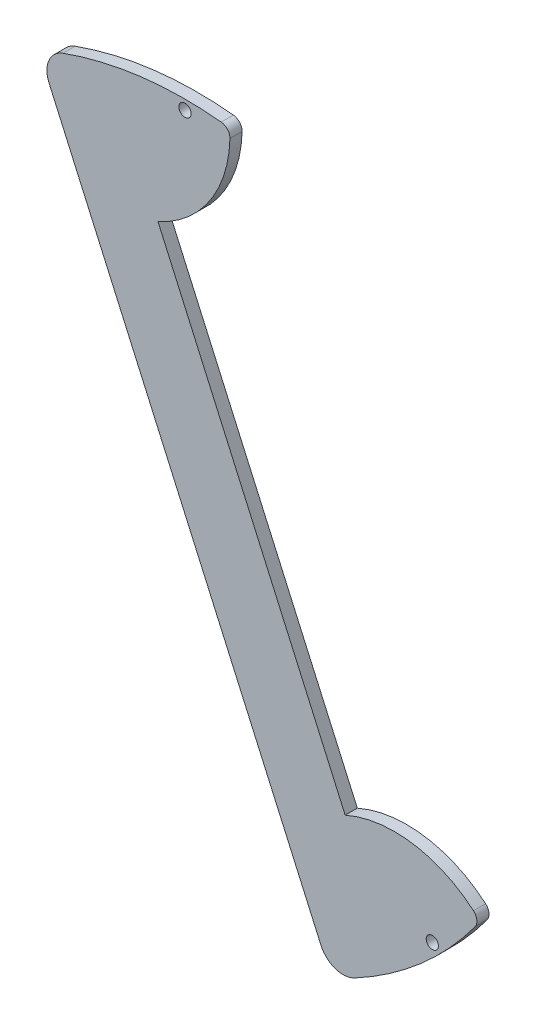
ISO-10303-21;
HEADER;
FILE_DESCRIPTION(('STEP AP214'),'2;1');
FILE_NAME('part.step','',(''),(''),'','','');
FILE_SCHEMA(('AUTOMOTIVE_DESIGN { 1 0 10303 214 1 1 1 1 }'));
ENDSEC;
DATA;
#1=APPLICATION_CONTEXT('core data for automotive mechanical design processes');
#2=APPLICATION_PROTOCOL_DEFINITION('international standard','automotive_design',2000,#1);
#3=PRODUCT_CONTEXT('',#1,'mechanical');
#4=PRODUCT('Part','Part','',(#3));
#5=PRODUCT_RELATED_PRODUCT_CATEGORY('part','',(#4));
#6=PRODUCT_DEFINITION_FORMATION('','',#4);
#7=PRODUCT_DEFINITION_CONTEXT('part definition',#1,'design');
#8=PRODUCT_DEFINITION('design','',#6,#7);
#9=PRODUCT_DEFINITION_SHAPE('','',#8);
#10=(LENGTH_UNIT() NAMED_UNIT(*) SI_UNIT(.MILLI.,.METRE.));
#11=(NAMED_UNIT(*) PLANE_ANGLE_UNIT() SI_UNIT($,.RADIAN.));
#12=(NAMED_UNIT(*) SI_UNIT($,.STERADIAN.) SOLID_ANGLE_UNIT());
#13=UNCERTAINTY_MEASURE_WITH_UNIT(LENGTH_MEASURE(1.E-05),#10,'distance_accuracy_value','');
#14=(GEOMETRIC_REPRESENTATION_CONTEXT(3) GLOBAL_UNCERTAINTY_ASSIGNED_CONTEXT((#13)) GLOBAL_UNIT_ASSIGNED_CONTEXT((#10,
#11,#12)) REPRESENTATION_CONTEXT('',''));
#15=CARTESIAN_POINT('',(0.,0.,0.));
#16=DIRECTION('',(0.,0.,1.));
#17=DIRECTION('',(1.,0.,0.));
#18=AXIS2_PLACEMENT_3D('',#15,#16,#17);
#19=CARTESIAN_POINT('',(9.21498023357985,90.9744894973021,3.17499999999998));
#20=DIRECTION('',(0.,0.,1.));
#21=DIRECTION('',(1.,0.,0.));
#22=AXIS2_PLACEMENT_3D('',#19,#20,#21);
#23=PLANE('',#22);
#24=CARTESIAN_POINT('',(0.,91.44,3.17500000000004));
#25=DIRECTION('',(0.,0.,1.));
#26=DIRECTION('',(1.,0.,0.));
#27=AXIS2_PLACEMENT_3D('',#24,#25,#26);
#28=CIRCLE('',#27,1.59639);
#29=CARTESIAN_POINT('',(1.59639,91.44,3.17500000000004));
#30=VERTEX_POINT('',#29);
#31=EDGE_CURVE('E150',#30,#30,#28,.T.);
#32=ORIENTED_EDGE('',*,*,#31,.F.);
#33=EDGE_LOOP('',(#32));
#34=FACE_BOUND('',#33,.T.);
#35=CARTESIAN_POINT('',(9.21498023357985,90.9744894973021,3.17499999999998));
#36=DIRECTION('',(0.,0.,1.));
#37=DIRECTION('',(1.,0.,0.));
#38=AXIS2_PLACEMENT_3D('',#35,#36,#37);
#39=CIRCLE('',#38,2.54);
#40=CARTESIAN_POINT('',(11.7541436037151,90.909302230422,3.17499999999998));
#41=VERTEX_POINT('',#40);
#42=CARTESIAN_POINT('',(9.47095190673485,93.5015586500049,3.17499999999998));
#43=VERTEX_POINT('',#42);
#44=EDGE_CURVE('E165',#41,#43,#39,.T.);
#45=ORIENTED_EDGE('',*,*,#44,.T.);
#46=CARTESIAN_POINT('',(0.,0.,3.17500000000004));
#47=DIRECTION('',(0.,0.,1.));
#48=DIRECTION('',(1.,0.,0.));
#49=AXIS2_PLACEMENT_3D('',#46,#47,#48);
#50=CIRCLE('',#49,93.98);
#51=CARTESIAN_POINT('',(-31.9032406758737,88.3992286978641,3.17499999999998));
#52=VERTEX_POINT('',#51);
#53=EDGE_CURVE('E101',#43,#52,#50,.T.);
#54=ORIENTED_EDGE('',*,*,#53,.T.);
#55=CARTESIAN_POINT('',(-29.7476163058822,82.4263078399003,3.17499999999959));
#56=DIRECTION('',(0.,0.,1.));
#57=DIRECTION('',(1.,0.,0.));
#58=AXIS2_PLACEMENT_3D('',#55,#56,#57);
#59=CIRCLE('',#58,6.34999999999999);
#60=CARTESIAN_POINT('',(-35.5486299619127,79.843530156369,3.17499999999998));
#61=VERTEX_POINT('',#60);
#62=EDGE_CURVE('E186',#52,#61,#59,.T.);
#63=ORIENTED_EDGE('',*,*,#62,.T.);
#64=DIRECTION('',(0.406736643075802,-0.9135454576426,0.));
#65=VECTOR('',#64,1.);
#66=CARTESIAN_POINT('',(-35.5486299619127,79.843530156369,3.17499999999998));
#67=LINE('',#66,#65);
#68=CARTESIAN_POINT('',(35.5486299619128,-79.8435301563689,3.17499999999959));
#69=VERTEX_POINT('',#68);
#70=EDGE_CURVE('E205',#61,#69,#67,.T.);
#71=ORIENTED_EDGE('',*,*,#70,.T.);
#72=CARTESIAN_POINT('',(41.3496436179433,-77.2607524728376,3.17499999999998));
#73=DIRECTION('',(0.,0.,1.));
#74=DIRECTION('',(-1.,0.,0.));
#75=AXIS2_PLACEMENT_3D('',#72,#73,#74);
#76=CIRCLE('',#75,6.35000000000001);
#77=CARTESIAN_POINT('',(44.3459946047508,-82.8593577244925,3.17499999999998));
#78=VERTEX_POINT('',#77);
#79=EDGE_CURVE('E202',#69,#78,#76,.T.);
#80=ORIENTED_EDGE('',*,*,#79,.T.);
#81=CARTESIAN_POINT('',(0.,0.,3.17500000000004));
#82=DIRECTION('',(0.,0.,1.));
#83=DIRECTION('',(1.,0.,0.));
#84=AXIS2_PLACEMENT_3D('',#81,#82,#83);
#85=CIRCLE('',#84,93.98);
#86=CARTESIAN_POINT('',(75.8225032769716,-55.5264657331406,3.17499999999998));
#87=VERTEX_POINT('',#86);
#88=EDGE_CURVE('E204',#78,#87,#85,.T.);
#89=ORIENTED_EDGE('',*,*,#88,.T.);
#90=CARTESIAN_POINT('',(73.773246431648,-54.0257504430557,3.17499999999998));
#91=DIRECTION('',(0.,0.,1.));
#92=DIRECTION('',(1.,0.,0.));
#93=AXIS2_PLACEMENT_3D('',#90,#91,#92);
#94=CIRCLE('',#93,2.54);
#95=CARTESIAN_POINT('',(75.4238347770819,-52.0951655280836,3.17499999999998));
#96=VERTEX_POINT('',#95);
#97=EDGE_CURVE('E128',#87,#96,#94,.T.);
#98=ORIENTED_EDGE('',*,*,#97,.T.);
#99=CARTESIAN_POINT('',(54.7914804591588,-76.2274769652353,3.17499999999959));
#100=DIRECTION('',(0.,0.,1.));
#101=DIRECTION('',(1.,0.,0.));
#102=AXIS2_PLACEMENT_3D('',#99,#100,#101);
#103=CIRCLE('',#102,31.75);
#104=CARTESIAN_POINT('',(41.8775920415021,-47.2224086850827,3.17499999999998));
#105=VERTEX_POINT('',#104);
#106=EDGE_CURVE('E122',#96,#105,#103,.T.);
#107=ORIENTED_EDGE('',*,*,#106,.T.);
#108=DIRECTION('',(-0.406736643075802,0.9135454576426,0.));
#109=VECTOR('',#108,1.);
#110=CARTESIAN_POINT('',(-7.07151010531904,62.7190747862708,3.17499999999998));
#111=LINE('',#110,#109);
#112=CARTESIAN_POINT('',(-7.07151010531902,62.7190747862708,3.17499999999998));
#113=VERTEX_POINT('',#112);
#114=EDGE_CURVE('E126',#105,#113,#111,.T.);
#115=ORIENTED_EDGE('',*,*,#114,.T.);
#116=CARTESIAN_POINT('',(-19.9853985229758,91.7241430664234,3.17499999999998));
#117=DIRECTION('',(0.,0.,1.));
#118=DIRECTION('',(-1.,0.,0.));
#119=AXIS2_PLACEMENT_3D('',#116,#117,#118);
#120=CIRCLE('',#119,31.75);
#121=EDGE_CURVE('E51',#113,#41,#120,.T.);
#122=ORIENTED_EDGE('',*,*,#121,.T.);
#123=EDGE_LOOP('',(#45,#54,#63,#71,#80,#89,#98,#107,#115,#122));
#124=FACE_BOUND('',#123,.T.);
#125=CARTESIAN_POINT('',(64.6578440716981,-64.6578440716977,3.17499999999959));
#126=DIRECTION('',(0.,0.,1.));
#127=DIRECTION('',(1.,0.,0.));
#128=AXIS2_PLACEMENT_3D('',#125,#126,#127);
#129=CIRCLE('',#128,1.59639);
#130=CARTESIAN_POINT('',(66.2542340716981,-64.6578440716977,3.17499999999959));
#131=VERTEX_POINT('',#130);
#132=EDGE_CURVE('E216',#131,#131,#129,.T.);
#133=ORIENTED_EDGE('',*,*,#132,.F.);
#134=EDGE_LOOP('',(#133));
#135=FACE_BOUND('',#134,.T.);
#136=ADVANCED_FACE('F34',(#34,#124,#135),#23,.T.);
#137=CARTESIAN_POINT('',(9.21498023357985,90.9744894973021,0.));
#138=DIRECTION('',(0.,0.,1.));
#139=DIRECTION('',(1.,0.,0.));
#140=AXIS2_PLACEMENT_3D('',#137,#138,#139);
#141=PLANE('',#140);
#142=CARTESIAN_POINT('',(0.,91.44,0.));
#143=DIRECTION('',(0.,0.,1.));
#144=DIRECTION('',(1.,0.,0.));
#145=AXIS2_PLACEMENT_3D('',#142,#143,#144);
#146=CIRCLE('',#145,1.59639);
#147=CARTESIAN_POINT('',(1.59639,91.44,0.));
#148=VERTEX_POINT('',#147);
#149=EDGE_CURVE('E213',#148,#148,#146,.T.);
#150=ORIENTED_EDGE('',*,*,#149,.T.);
#151=EDGE_LOOP('',(#150));
#152=FACE_BOUND('',#151,.T.);
#153=CARTESIAN_POINT('',(9.21498023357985,90.9744894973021,0.));
#154=DIRECTION('',(0.,0.,1.));
#155=DIRECTION('',(1.,0.,0.));
#156=AXIS2_PLACEMENT_3D('',#153,#154,#155);
#157=CIRCLE('',#156,2.54);
#158=CARTESIAN_POINT('',(11.7541436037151,90.909302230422,0.));
#159=VERTEX_POINT('',#158);
#160=CARTESIAN_POINT('',(9.47095190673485,93.5015586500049,0.));
#161=VERTEX_POINT('',#160);
#162=EDGE_CURVE('E146',#159,#161,#157,.T.);
#163=ORIENTED_EDGE('',*,*,#162,.F.);
#164=CARTESIAN_POINT('',(-19.9853985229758,91.7241430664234,0.));
#165=DIRECTION('',(0.,0.,1.));
#166=DIRECTION('',(-1.,0.,0.));
#167=AXIS2_PLACEMENT_3D('',#164,#165,#166);
#168=CIRCLE('',#167,31.75);
#169=CARTESIAN_POINT('',(-7.07151010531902,62.7190747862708,0.));
#170=VERTEX_POINT('',#169);
#171=EDGE_CURVE('E93',#170,#159,#168,.T.);
#172=ORIENTED_EDGE('',*,*,#171,.F.);
#173=DIRECTION('',(-0.406736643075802,0.9135454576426,0.));
#174=VECTOR('',#173,1.);
#175=CARTESIAN_POINT('',(-7.07151010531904,62.7190747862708,0.));
#176=LINE('',#175,#174);
#177=CARTESIAN_POINT('',(41.8775920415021,-47.2224086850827,0.));
#178=VERTEX_POINT('',#177);
#179=EDGE_CURVE('E87',#178,#170,#176,.T.);
#180=ORIENTED_EDGE('',*,*,#179,.F.);
#181=CARTESIAN_POINT('',(54.7914804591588,-76.2274769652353,-4.44089209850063E-13));
#182=DIRECTION('',(0.,0.,1.));
#183=DIRECTION('',(1.,0.,0.));
#184=AXIS2_PLACEMENT_3D('',#181,#182,#183);
#185=CIRCLE('',#184,31.75);
#186=CARTESIAN_POINT('',(75.4238347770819,-52.0951655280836,0.));
#187=VERTEX_POINT('',#186);
#188=EDGE_CURVE('E136',#187,#178,#185,.T.);
#189=ORIENTED_EDGE('',*,*,#188,.F.);
#190=CARTESIAN_POINT('',(73.773246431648,-54.0257504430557,0.));
#191=DIRECTION('',(0.,0.,1.));
#192=DIRECTION('',(1.,0.,0.));
#193=AXIS2_PLACEMENT_3D('',#190,#191,#192);
#194=CIRCLE('',#193,2.54);
#195=CARTESIAN_POINT('',(75.8225032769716,-55.5264657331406,0.));
#196=VERTEX_POINT('',#195);
#197=EDGE_CURVE('E160',#196,#187,#194,.T.);
#198=ORIENTED_EDGE('',*,*,#197,.F.);
#199=CARTESIAN_POINT('',(0.,0.,0.));
#200=DIRECTION('',(0.,0.,1.));
#201=DIRECTION('',(1.,0.,0.));
#202=AXIS2_PLACEMENT_3D('',#199,#200,#201);
#203=CIRCLE('',#202,93.98);
#204=CARTESIAN_POINT('',(44.3459946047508,-82.8593577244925,0.));
#205=VERTEX_POINT('',#204);
#206=EDGE_CURVE('E158',#205,#196,#203,.T.);
#207=ORIENTED_EDGE('',*,*,#206,.F.);
#208=CARTESIAN_POINT('',(41.3496436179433,-77.2607524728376,0.));
#209=DIRECTION('',(0.,0.,1.));
#210=DIRECTION('',(-1.,0.,0.));
#211=AXIS2_PLACEMENT_3D('',#208,#209,#210);
#212=CIRCLE('',#211,6.35000000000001);
#213=CARTESIAN_POINT('',(35.5486299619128,-79.8435301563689,-4.44089209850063E-13));
#214=VERTEX_POINT('',#213);
#215=EDGE_CURVE('E156',#214,#205,#212,.T.);
#216=ORIENTED_EDGE('',*,*,#215,.F.);
#217=DIRECTION('',(0.406736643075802,-0.9135454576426,0.));
#218=VECTOR('',#217,1.);
#219=CARTESIAN_POINT('',(-35.5486299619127,79.843530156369,0.));
#220=LINE('',#219,#218);
#221=CARTESIAN_POINT('',(-35.5486299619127,79.843530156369,0.));
#222=VERTEX_POINT('',#221);
#223=EDGE_CURVE('E154',#222,#214,#220,.T.);
#224=ORIENTED_EDGE('',*,*,#223,.F.);
#225=CARTESIAN_POINT('',(-29.7476163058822,82.4263078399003,-4.44089209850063E-13));
#226=DIRECTION('',(0.,0.,1.));
#227=DIRECTION('',(1.,0.,0.));
#228=AXIS2_PLACEMENT_3D('',#225,#226,#227);
#229=CIRCLE('',#228,6.34999999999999);
#230=CARTESIAN_POINT('',(-31.9032406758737,88.3992286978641,0.));
#231=VERTEX_POINT('',#230);
#232=EDGE_CURVE('E152',#231,#222,#229,.T.);
#233=ORIENTED_EDGE('',*,*,#232,.F.);
#234=CARTESIAN_POINT('',(0.,0.,0.));
#235=DIRECTION('',(0.,0.,1.));
#236=DIRECTION('',(1.,0.,0.));
#237=AXIS2_PLACEMENT_3D('',#234,#235,#236);
#238=CIRCLE('',#237,93.98);
#239=EDGE_CURVE('E149',#161,#231,#238,.T.);
#240=ORIENTED_EDGE('',*,*,#239,.F.);
#241=EDGE_LOOP('',(#163,#172,#180,#189,#198,#207,#216,#224,#233,#240));
#242=FACE_BOUND('',#241,.T.);
#243=CARTESIAN_POINT('',(64.6578440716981,-64.6578440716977,-4.44089209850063E-13));
#244=DIRECTION('',(0.,0.,1.));
#245=DIRECTION('',(1.,0.,0.));
#246=AXIS2_PLACEMENT_3D('',#243,#244,#245);
#247=CIRCLE('',#246,1.59639);
#248=CARTESIAN_POINT('',(66.2542340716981,-64.6578440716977,-4.44089209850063E-13));
#249=VERTEX_POINT('',#248);
#250=EDGE_CURVE('E219',#249,#249,#247,.T.);
#251=ORIENTED_EDGE('',*,*,#250,.T.);
#252=EDGE_LOOP('',(#251));
#253=FACE_BOUND('',#252,.T.);
#254=ADVANCED_FACE('F190',(#152,#242,#253),#141,.F.);
#255=CARTESIAN_POINT('',(9.21498023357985,90.9744894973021,3.17499999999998));
#256=DIRECTION('',(0.,0.,-1.));
#257=DIRECTION('',(-1.,0.,0.));
#258=AXIS2_PLACEMENT_3D('',#255,#256,#257);
#259=CYLINDRICAL_SURFACE('',#258,2.54);
#260=ORIENTED_EDGE('',*,*,#162,.T.);
#261=DIRECTION('',(0.,0.,-1.));
#262=VECTOR('',#261,1.);
#263=CARTESIAN_POINT('',(9.47095190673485,93.5015586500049,3.17499999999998));
#264=LINE('',#263,#262);
#265=EDGE_CURVE('E11',#43,#161,#264,.T.);
#266=ORIENTED_EDGE('',*,*,#265,.F.);
#267=ORIENTED_EDGE('',*,*,#44,.F.);
#268=DIRECTION('',(0.,0.,-1.));
#269=VECTOR('',#268,1.);
#270=CARTESIAN_POINT('',(11.7541436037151,90.909302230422,3.17499999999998));
#271=LINE('',#270,#269);
#272=EDGE_CURVE('E142',#41,#159,#271,.T.);
#273=ORIENTED_EDGE('',*,*,#272,.T.);
#274=EDGE_LOOP('',(#260,#266,#267,#273));
#275=FACE_BOUND('',#274,.T.);
#276=ADVANCED_FACE('F36',(#275),#259,.T.);
#277=CARTESIAN_POINT('',(0.,0.,3.17500000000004));
#278=DIRECTION('',(0.,0.,-1.));
#279=DIRECTION('',(-1.,0.,0.));
#280=AXIS2_PLACEMENT_3D('',#277,#278,#279);
#281=CYLINDRICAL_SURFACE('',#280,93.98);
#282=ORIENTED_EDGE('',*,*,#239,.T.);
#283=DIRECTION('',(0.,0.,-1.));
#284=VECTOR('',#283,1.);
#285=CARTESIAN_POINT('',(-31.9032406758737,88.3992286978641,3.17499999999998));
#286=LINE('',#285,#284);
#287=EDGE_CURVE('E43',#52,#231,#286,.T.);
#288=ORIENTED_EDGE('',*,*,#287,.F.);
#289=ORIENTED_EDGE('',*,*,#53,.F.);
#290=ORIENTED_EDGE('',*,*,#265,.T.);
#291=EDGE_LOOP('',(#282,#288,#289,#290));
#292=FACE_BOUND('',#291,.T.);
#293=ADVANCED_FACE('F300',(#292),#281,.T.);
#294=CARTESIAN_POINT('',(-29.7476163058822,82.4263078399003,3.17499999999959));
#295=DIRECTION('',(0.,0.,-1.));
#296=DIRECTION('',(-1.,0.,0.));
#297=AXIS2_PLACEMENT_3D('',#294,#295,#296);
#298=CYLINDRICAL_SURFACE('',#297,6.34999999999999);
#299=ORIENTED_EDGE('',*,*,#232,.T.);
#300=DIRECTION('',(0.,0.,-1.));
#301=VECTOR('',#300,1.);
#302=CARTESIAN_POINT('',(-35.5486299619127,79.843530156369,3.17499999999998));
#303=LINE('',#302,#301);
#304=EDGE_CURVE('E178',#61,#222,#303,.T.);
#305=ORIENTED_EDGE('',*,*,#304,.F.);
#306=ORIENTED_EDGE('',*,*,#62,.F.);
#307=ORIENTED_EDGE('',*,*,#287,.T.);
#308=EDGE_LOOP('',(#299,#305,#306,#307));
#309=FACE_BOUND('',#308,.T.);
#310=ADVANCED_FACE('F184',(#309),#298,.T.);
#311=CARTESIAN_POINT('',(-35.5486299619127,79.843530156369,3.17499999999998));
#312=DIRECTION('',(0.9135454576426,0.406736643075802,0.));
#313=DIRECTION('',(-0.406736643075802,0.9135454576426,0.));
#314=AXIS2_PLACEMENT_3D('',#311,#312,#313);
#315=PLANE('',#314);
#316=CARTESIAN_POINT('',(-30.9933322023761,69.6121638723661,1.58749999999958));
#317=DIRECTION('',(-0.9135454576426,-0.406736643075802,0.));
#318=DIRECTION('',(0.406736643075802,-0.9135454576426,0.));
#319=AXIS2_PLACEMENT_3D('',#316,#317,#318);
#320=CIRCLE('',#319,1.13029999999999);
#321=CARTESIAN_POINT('',(-30.5335977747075,68.5795834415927,1.58749999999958));
#322=VERTEX_POINT('',#321);
#323=EDGE_CURVE('E239',#322,#322,#320,.T.);
#324=ORIENTED_EDGE('',*,*,#323,.F.);
#325=EDGE_LOOP('',(#324));
#326=FACE_BOUND('',#325,.T.);
#327=CARTESIAN_POINT('',(0.,0.,1.58749999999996));
#328=DIRECTION('',(-0.9135454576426,-0.406736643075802,0.));
#329=DIRECTION('',(0.406736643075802,-0.9135454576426,0.));
#330=AXIS2_PLACEMENT_3D('',#327,#328,#329);
#331=CIRCLE('',#330,1.13029999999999);
#332=CARTESIAN_POINT('',(0.459734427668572,-1.03258043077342,1.58749999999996));
#333=VERTEX_POINT('',#332);
#334=EDGE_CURVE('E233',#333,#333,#331,.T.);
#335=ORIENTED_EDGE('',*,*,#334,.F.);
#336=EDGE_LOOP('',(#335));
#337=FACE_BOUND('',#336,.T.);
#338=CARTESIAN_POINT('',(30.9933322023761,-69.6121638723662,1.58749999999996));
#339=DIRECTION('',(-0.9135454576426,-0.406736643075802,0.));
#340=DIRECTION('',(0.406736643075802,-0.9135454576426,0.));
#341=AXIS2_PLACEMENT_3D('',#338,#339,#340);
#342=CIRCLE('',#341,1.13029999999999);
#343=CARTESIAN_POINT('',(31.4530666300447,-70.6447443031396,1.58749999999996));
#344=VERTEX_POINT('',#343);
#345=EDGE_CURVE('E227',#344,#344,#342,.T.);
#346=ORIENTED_EDGE('',*,*,#345,.F.);
#347=EDGE_LOOP('',(#346));
#348=FACE_BOUND('',#347,.T.);
#349=ORIENTED_EDGE('',*,*,#223,.T.);
#350=DIRECTION('',(0.,0.,-1.));
#351=VECTOR('',#350,1.);
#352=CARTESIAN_POINT('',(35.5486299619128,-79.8435301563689,3.17499999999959));
#353=LINE('',#352,#351);
#354=EDGE_CURVE('E175',#69,#214,#353,.T.);
#355=ORIENTED_EDGE('',*,*,#354,.F.);
#356=ORIENTED_EDGE('',*,*,#70,.F.);
#357=ORIENTED_EDGE('',*,*,#304,.T.);
#358=EDGE_LOOP('',(#349,#355,#356,#357));
#359=FACE_BOUND('',#358,.T.);
#360=ADVANCED_FACE('F196',(#326,#337,#348,#359),#315,.F.);
#361=CARTESIAN_POINT('',(41.3496436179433,-77.2607524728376,3.17499999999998));
#362=DIRECTION('',(0.,0.,-1.));
#363=DIRECTION('',(-1.,0.,0.));
#364=AXIS2_PLACEMENT_3D('',#361,#362,#363);
#365=CYLINDRICAL_SURFACE('',#364,6.35000000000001);
#366=ORIENTED_EDGE('',*,*,#215,.T.);
#367=DIRECTION('',(0.,0.,-1.));
#368=VECTOR('',#367,1.);
#369=CARTESIAN_POINT('',(44.3459946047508,-82.8593577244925,3.17499999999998));
#370=LINE('',#369,#368);
#371=EDGE_CURVE('E172',#78,#205,#370,.T.);
#372=ORIENTED_EDGE('',*,*,#371,.F.);
#373=ORIENTED_EDGE('',*,*,#79,.F.);
#374=ORIENTED_EDGE('',*,*,#354,.T.);
#375=EDGE_LOOP('',(#366,#372,#373,#374));
#376=FACE_BOUND('',#375,.T.);
#377=ADVANCED_FACE('F200',(#376),#365,.T.);
#378=CARTESIAN_POINT('',(0.,0.,3.17500000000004));
#379=DIRECTION('',(0.,0.,-1.));
#380=DIRECTION('',(-1.,0.,0.));
#381=AXIS2_PLACEMENT_3D('',#378,#379,#380);
#382=CYLINDRICAL_SURFACE('',#381,93.98);
#383=ORIENTED_EDGE('',*,*,#206,.T.);
#384=DIRECTION('',(0.,0.,-1.));
#385=VECTOR('',#384,1.);
#386=CARTESIAN_POINT('',(75.8225032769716,-55.5264657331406,3.17499999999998));
#387=LINE('',#386,#385);
#388=EDGE_CURVE('E169',#87,#196,#387,.T.);
#389=ORIENTED_EDGE('',*,*,#388,.F.);
#390=ORIENTED_EDGE('',*,*,#88,.F.);
#391=ORIENTED_EDGE('',*,*,#371,.T.);
#392=EDGE_LOOP('',(#383,#389,#390,#391));
#393=FACE_BOUND('',#392,.T.);
#394=ADVANCED_FACE('F292',(#393),#382,.T.);
#395=CARTESIAN_POINT('',(73.773246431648,-54.0257504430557,3.17499999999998));
#396=DIRECTION('',(0.,0.,-1.));
#397=DIRECTION('',(-1.,0.,0.));
#398=AXIS2_PLACEMENT_3D('',#395,#396,#397);
#399=CYLINDRICAL_SURFACE('',#398,2.54);
#400=ORIENTED_EDGE('',*,*,#197,.T.);
#401=DIRECTION('',(0.,0.,-1.));
#402=VECTOR('',#401,1.);
#403=CARTESIAN_POINT('',(75.4238347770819,-52.0951655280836,3.17499999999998));
#404=LINE('',#403,#402);
#405=EDGE_CURVE('E137',#96,#187,#404,.T.);
#406=ORIENTED_EDGE('',*,*,#405,.F.);
#407=ORIENTED_EDGE('',*,*,#97,.F.);
#408=ORIENTED_EDGE('',*,*,#388,.T.);
#409=EDGE_LOOP('',(#400,#406,#407,#408));
#410=FACE_BOUND('',#409,.T.);
#411=ADVANCED_FACE('F289',(#410),#399,.T.);
#412=CARTESIAN_POINT('',(54.7914804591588,-76.2274769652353,3.17499999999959));
#413=DIRECTION('',(0.,0.,-1.));
#414=DIRECTION('',(-1.,0.,0.));
#415=AXIS2_PLACEMENT_3D('',#412,#413,#414);
#416=CYLINDRICAL_SURFACE('',#415,31.75);
#417=ORIENTED_EDGE('',*,*,#188,.T.);
#418=DIRECTION('',(0.,0.,-1.));
#419=VECTOR('',#418,1.);
#420=CARTESIAN_POINT('',(41.8775920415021,-47.2224086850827,3.17499999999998));
#421=LINE('',#420,#419);
#422=EDGE_CURVE('E133',#105,#178,#421,.T.);
#423=ORIENTED_EDGE('',*,*,#422,.F.);
#424=ORIENTED_EDGE('',*,*,#106,.F.);
#425=ORIENTED_EDGE('',*,*,#405,.T.);
#426=EDGE_LOOP('',(#417,#423,#424,#425));
#427=FACE_BOUND('',#426,.T.);
#428=ADVANCED_FACE('F134',(#427),#416,.T.);
#429=CARTESIAN_POINT('',(-7.07151010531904,62.7190747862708,3.17499999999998));
#430=DIRECTION('',(-0.9135454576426,-0.406736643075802,0.));
#431=DIRECTION('',(0.406736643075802,-0.9135454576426,0.));
#432=AXIS2_PLACEMENT_3D('',#429,#430,#431);
#433=PLANE('',#432);
#434=ORIENTED_EDGE('',*,*,#179,.T.);
#435=DIRECTION('',(0.,0.,-1.));
#436=VECTOR('',#435,1.);
#437=CARTESIAN_POINT('',(-7.07151010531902,62.7190747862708,3.17499999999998));
#438=LINE('',#437,#436);
#439=EDGE_CURVE('E138',#113,#170,#438,.T.);
#440=ORIENTED_EDGE('',*,*,#439,.F.);
#441=ORIENTED_EDGE('',*,*,#114,.F.);
#442=ORIENTED_EDGE('',*,*,#422,.T.);
#443=EDGE_LOOP('',(#434,#440,#441,#442));
#444=FACE_BOUND('',#443,.T.);
#445=ADVANCED_FACE('F140',(#444),#433,.F.);
#446=CARTESIAN_POINT('',(-19.9853985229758,91.7241430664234,3.17499999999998));
#447=DIRECTION('',(0.,0.,-1.));
#448=DIRECTION('',(-1.,0.,0.));
#449=AXIS2_PLACEMENT_3D('',#446,#447,#448);
#450=CYLINDRICAL_SURFACE('',#449,31.75);
#451=ORIENTED_EDGE('',*,*,#171,.T.);
#452=ORIENTED_EDGE('',*,*,#272,.F.);
#453=ORIENTED_EDGE('',*,*,#121,.F.);
#454=ORIENTED_EDGE('',*,*,#439,.T.);
#455=EDGE_LOOP('',(#451,#452,#453,#454));
#456=FACE_BOUND('',#455,.T.);
#457=ADVANCED_FACE('F282',(#456),#450,.T.);
#458=CARTESIAN_POINT('',(0.,91.44,3.17500000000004));
#459=DIRECTION('',(0.,0.,-1.));
#460=DIRECTION('',(-1.,0.,0.));
#461=AXIS2_PLACEMENT_3D('',#458,#459,#460);
#462=CYLINDRICAL_SURFACE('',#461,1.59639);
#463=ORIENTED_EDGE('',*,*,#31,.T.);
#464=EDGE_LOOP('',(#463));
#465=FACE_BOUND('',#464,.T.);
#466=ORIENTED_EDGE('',*,*,#149,.F.);
#467=EDGE_LOOP('',(#466));
#468=FACE_BOUND('',#467,.T.);
#469=ADVANCED_FACE('F279',(#465,#468),#462,.F.);
#470=CARTESIAN_POINT('',(64.6578440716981,-64.6578440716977,3.17499999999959));
#471=DIRECTION('',(0.,0.,-1.));
#472=DIRECTION('',(-1.,0.,0.));
#473=AXIS2_PLACEMENT_3D('',#470,#471,#472);
#474=CYLINDRICAL_SURFACE('',#473,1.59639);
#475=ORIENTED_EDGE('',*,*,#132,.T.);
#476=EDGE_LOOP('',(#475));
#477=FACE_BOUND('',#476,.T.);
#478=ORIENTED_EDGE('',*,*,#250,.F.);
#479=EDGE_LOOP('',(#478));
#480=FACE_BOUND('',#479,.T.);
#481=ADVANCED_FACE('F265',(#477,#480),#474,.F.);
#482=CARTESIAN_POINT('',(39.1147513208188,-65.9962751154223,1.58749999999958));
#483=DIRECTION('',(-0.9135454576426,-0.406736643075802,0.));
#484=DIRECTION('',(0.406736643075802,-0.9135454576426,0.));
#485=AXIS2_PLACEMENT_3D('',#482,#483,#484);
#486=CONICAL_SURFACE('',#485,1.13029999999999,1.02974425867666);
#487=CARTESIAN_POINT('',(39.7351882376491,-65.7200388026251,1.58749999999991));
#488=VERTEX_POINT('',#487);
#489=VERTEX_LOOP('',#488);
#490=FACE_BOUND('',#489,.T.);
#491=CARTESIAN_POINT('',(39.1147513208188,-65.9962751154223,1.58749999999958));
#492=DIRECTION('',(-0.9135454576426,-0.406736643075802,0.));
#493=DIRECTION('',(0.406736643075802,-0.9135454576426,0.));
#494=AXIS2_PLACEMENT_3D('',#491,#492,#493);
#495=CIRCLE('',#494,1.13029999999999);
#496=CARTESIAN_POINT('',(39.5744857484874,-67.0288555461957,1.58749999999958));
#497=VERTEX_POINT('',#496);
#498=EDGE_CURVE('E222',#497,#497,#495,.T.);
#499=ORIENTED_EDGE('',*,*,#498,.T.);
#500=EDGE_LOOP('',(#499));
#501=FACE_BOUND('',#500,.T.);
#502=ADVANCED_FACE('F255',(#490,#501),#486,.F.);
#503=CARTESIAN_POINT('',(30.9933322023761,-69.6121638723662,1.58749999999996));
#504=DIRECTION('',(-0.9135454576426,-0.406736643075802,0.));
#505=DIRECTION('',(0.406736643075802,-0.9135454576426,0.));
#506=AXIS2_PLACEMENT_3D('',#503,#504,#505);
#507=CYLINDRICAL_SURFACE('',#506,1.13029999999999);
#508=ORIENTED_EDGE('',*,*,#498,.F.);
#509=EDGE_LOOP('',(#508));
#510=FACE_BOUND('',#509,.T.);
#511=ORIENTED_EDGE('',*,*,#345,.T.);
#512=EDGE_LOOP('',(#511));
#513=FACE_BOUND('',#512,.T.);
#514=ADVANCED_FACE('F252',(#510,#513),#507,.F.);
#515=CARTESIAN_POINT('',(8.12141911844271,3.61588875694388,1.58749999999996));
#516=DIRECTION('',(-0.9135454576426,-0.406736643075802,0.));
#517=DIRECTION('',(0.406736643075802,-0.9135454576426,0.));
#518=AXIS2_PLACEMENT_3D('',#515,#516,#517);
#519=CONICAL_SURFACE('',#518,1.13029999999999,1.02974425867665);
#520=CARTESIAN_POINT('',(8.74185603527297,3.8921250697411,1.58749999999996));
#521=VERTEX_POINT('',#520);
#522=VERTEX_LOOP('',#521);
#523=FACE_BOUND('',#522,.T.);
#524=CARTESIAN_POINT('',(8.12141911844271,3.61588875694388,1.58749999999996));
#525=DIRECTION('',(-0.9135454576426,-0.406736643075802,0.));
#526=DIRECTION('',(0.406736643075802,-0.9135454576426,0.));
#527=AXIS2_PLACEMENT_3D('',#524,#525,#526);
#528=CIRCLE('',#527,1.13029999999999);
#529=CARTESIAN_POINT('',(8.58115354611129,2.58330832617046,1.58749999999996));
#530=VERTEX_POINT('',#529);
#531=EDGE_CURVE('E230',#530,#530,#528,.T.);
#532=ORIENTED_EDGE('',*,*,#531,.T.);
#533=EDGE_LOOP('',(#532));
#534=FACE_BOUND('',#533,.T.);
#535=ADVANCED_FACE('F254',(#523,#534),#519,.F.);
#536=CARTESIAN_POINT('',(0.,0.,1.58749999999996));
#537=DIRECTION('',(-0.9135454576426,-0.406736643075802,0.));
#538=DIRECTION('',(0.406736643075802,-0.9135454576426,0.));
#539=AXIS2_PLACEMENT_3D('',#536,#537,#538);
#540=CYLINDRICAL_SURFACE('',#539,1.13029999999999);
#541=ORIENTED_EDGE('',*,*,#531,.F.);
#542=EDGE_LOOP('',(#541));
#543=FACE_BOUND('',#542,.T.);
#544=ORIENTED_EDGE('',*,*,#334,.T.);
#545=EDGE_LOOP('',(#544));
#546=FACE_BOUND('',#545,.T.);
#547=ADVANCED_FACE('F262',(#543,#546),#540,.F.);
#548=CARTESIAN_POINT('',(-22.8719130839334,73.22805262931,1.58749999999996));
#549=DIRECTION('',(-0.9135454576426,-0.406736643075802,0.));
#550=DIRECTION('',(0.406736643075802,-0.9135454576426,0.));
#551=AXIS2_PLACEMENT_3D('',#548,#549,#550);
#552=CONICAL_SURFACE('',#551,1.13029999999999,1.02974425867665);
#553=CARTESIAN_POINT('',(-22.2514761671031,73.5042889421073,1.58749999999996));
#554=VERTEX_POINT('',#553);
#555=VERTEX_LOOP('',#554);
#556=FACE_BOUND('',#555,.T.);
#557=CARTESIAN_POINT('',(-22.8719130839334,73.22805262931,1.58749999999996));
#558=DIRECTION('',(-0.9135454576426,-0.406736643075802,0.));
#559=DIRECTION('',(0.406736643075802,-0.9135454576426,0.));
#560=AXIS2_PLACEMENT_3D('',#557,#558,#559);
#561=CIRCLE('',#560,1.13029999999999);
#562=CARTESIAN_POINT('',(-22.4121786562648,72.1954721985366,1.58749999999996));
#563=VERTEX_POINT('',#562);
#564=EDGE_CURVE('E236',#563,#563,#561,.T.);
#565=ORIENTED_EDGE('',*,*,#564,.T.);
#566=EDGE_LOOP('',(#565));
#567=FACE_BOUND('',#566,.T.);
#568=ADVANCED_FACE('F384',(#556,#567),#552,.F.);
#569=CARTESIAN_POINT('',(-30.9933322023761,69.6121638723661,1.58749999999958));
#570=DIRECTION('',(-0.9135454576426,-0.406736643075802,0.));
#571=DIRECTION('',(0.406736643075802,-0.9135454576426,0.));
#572=AXIS2_PLACEMENT_3D('',#569,#570,#571);
#573=CYLINDRICAL_SURFACE('',#572,1.13029999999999);
#574=ORIENTED_EDGE('',*,*,#564,.F.);
#575=EDGE_LOOP('',(#574));
#576=FACE_BOUND('',#575,.T.);
#577=ORIENTED_EDGE('',*,*,#323,.T.);
#578=EDGE_LOOP('',(#577));
#579=FACE_BOUND('',#578,.T.);
#580=ADVANCED_FACE('F243',(#576,#579),#573,.F.);
#581=CLOSED_SHELL('',(#136,#254,#276,#293,#310,#360,#377,#394,#411,#428,#445,#457,#469,#481,
#502,#514,#535,#547,#568,#580));
#582=MANIFOLD_SOLID_BREP('B2',#581);
#583=ADVANCED_BREP_SHAPE_REPRESENTATION('',(#18,#582),#14);
#584=SHAPE_DEFINITION_REPRESENTATION(#9,#583);
ENDSEC;
END-ISO-10303-21;
